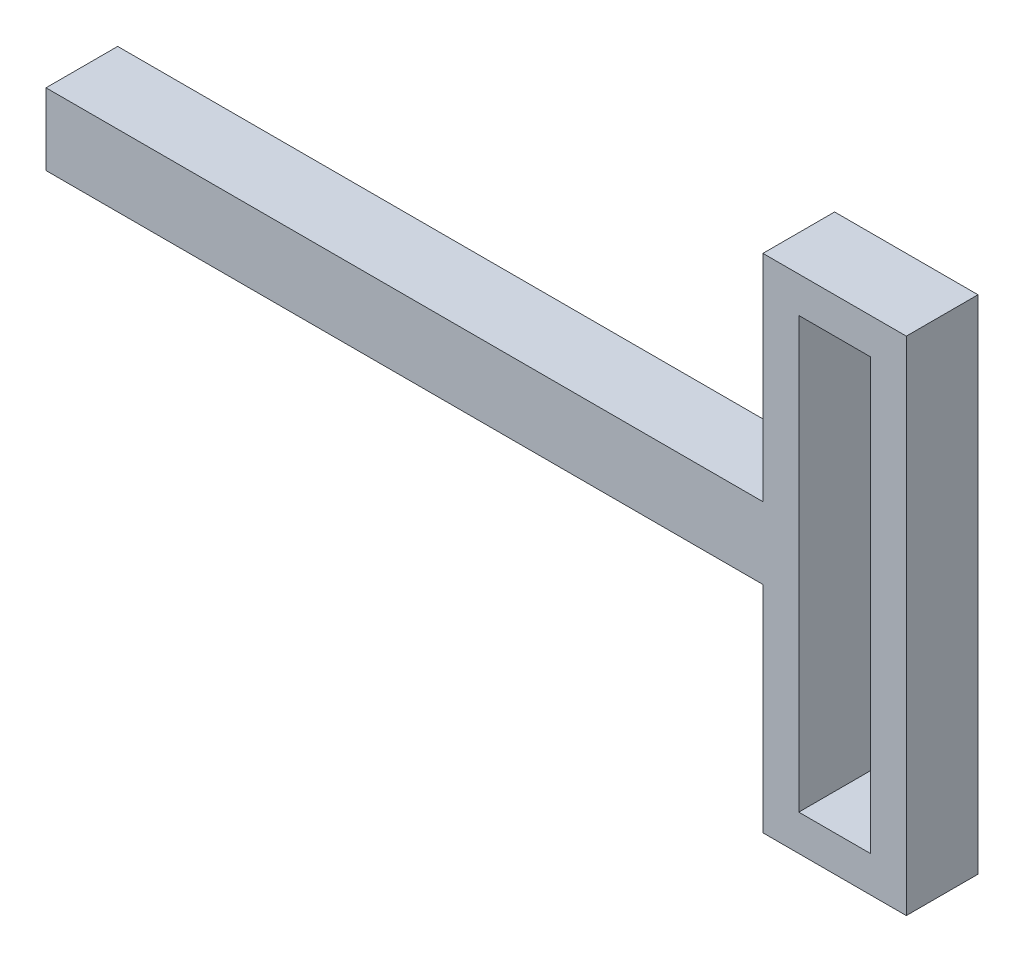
ISO-10303-21;
HEADER;
FILE_DESCRIPTION(('STEP AP214'),'2;1');
FILE_NAME('part.step','',(''),(''),'','','');
FILE_SCHEMA(('AUTOMOTIVE_DESIGN { 1 0 10303 214 1 1 1 1 }'));
ENDSEC;
DATA;
#1=APPLICATION_CONTEXT('core data for automotive mechanical design processes');
#2=APPLICATION_PROTOCOL_DEFINITION('international standard','automotive_design',2000,#1);
#3=PRODUCT_CONTEXT('',#1,'mechanical');
#4=PRODUCT('Part','Part','',(#3));
#5=PRODUCT_RELATED_PRODUCT_CATEGORY('part','',(#4));
#6=PRODUCT_DEFINITION_FORMATION('','',#4);
#7=PRODUCT_DEFINITION_CONTEXT('part definition',#1,'design');
#8=PRODUCT_DEFINITION('design','',#6,#7);
#9=PRODUCT_DEFINITION_SHAPE('','',#8);
#10=(LENGTH_UNIT() NAMED_UNIT(*) SI_UNIT(.MILLI.,.METRE.));
#11=(NAMED_UNIT(*) PLANE_ANGLE_UNIT() SI_UNIT($,.RADIAN.));
#12=(NAMED_UNIT(*) SI_UNIT($,.STERADIAN.) SOLID_ANGLE_UNIT());
#13=UNCERTAINTY_MEASURE_WITH_UNIT(LENGTH_MEASURE(1.E-05),#10,'distance_accuracy_value','');
#14=(GEOMETRIC_REPRESENTATION_CONTEXT(3) GLOBAL_UNCERTAINTY_ASSIGNED_CONTEXT((#13)) GLOBAL_UNIT_ASSIGNED_CONTEXT((#10,
#11,#12)) REPRESENTATION_CONTEXT('',''));
#15=CARTESIAN_POINT('',(0.,0.,0.));
#16=DIRECTION('',(0.,0.,1.));
#17=DIRECTION('',(1.,0.,0.));
#18=AXIS2_PLACEMENT_3D('',#15,#16,#17);
#19=CARTESIAN_POINT('',(100.,0.,10.));
#20=DIRECTION('',(0.,1.,0.));
#21=DIRECTION('',(-1.,0.,0.));
#22=AXIS2_PLACEMENT_3D('',#19,#20,#21);
#23=PLANE('',#22);
#24=DIRECTION('',(1.,0.,0.));
#25=VECTOR('',#24,1.);
#26=CARTESIAN_POINT('',(100.,0.,0.));
#27=LINE('',#26,#25);
#28=CARTESIAN_POINT('',(0.,0.,0.));
#29=VERTEX_POINT('',#28);
#30=CARTESIAN_POINT('',(100.,0.,0.));
#31=VERTEX_POINT('',#30);
#32=EDGE_CURVE('E153',#29,#31,#27,.T.);
#33=ORIENTED_EDGE('',*,*,#32,.T.);
#34=DIRECTION('',(0.,0.,-1.));
#35=VECTOR('',#34,1.);
#36=CARTESIAN_POINT('',(100.,0.,10.));
#37=LINE('',#36,#35);
#38=CARTESIAN_POINT('',(100.,0.,10.));
#39=VERTEX_POINT('',#38);
#40=EDGE_CURVE('E11',#39,#31,#37,.T.);
#41=ORIENTED_EDGE('',*,*,#40,.F.);
#42=DIRECTION('',(1.,0.,0.));
#43=VECTOR('',#42,1.);
#44=CARTESIAN_POINT('',(100.,0.,10.));
#45=LINE('',#44,#43);
#46=CARTESIAN_POINT('',(0.,0.,10.));
#47=VERTEX_POINT('',#46);
#48=EDGE_CURVE('E157',#47,#39,#45,.T.);
#49=ORIENTED_EDGE('',*,*,#48,.F.);
#50=DIRECTION('',(0.,0.,-1.));
#51=VECTOR('',#50,1.);
#52=CARTESIAN_POINT('',(0.,0.,10.));
#53=LINE('',#52,#51);
#54=EDGE_CURVE('E175',#47,#29,#53,.T.);
#55=ORIENTED_EDGE('',*,*,#54,.T.);
#56=EDGE_LOOP('',(#33,#41,#49,#55));
#57=FACE_BOUND('',#56,.T.);
#58=ADVANCED_FACE('F32',(#57),#23,.F.);
#59=CARTESIAN_POINT('',(100.,-30.,10.));
#60=DIRECTION('',(1.,0.,0.));
#61=DIRECTION('',(0.,0.,-1.));
#62=AXIS2_PLACEMENT_3D('',#59,#60,#61);
#63=PLANE('',#62);
#64=DIRECTION('',(0.,-1.,0.));
#65=VECTOR('',#64,1.);
#66=CARTESIAN_POINT('',(100.,-30.,0.));
#67=LINE('',#66,#65);
#68=CARTESIAN_POINT('',(100.,-30.,0.));
#69=VERTEX_POINT('',#68);
#70=EDGE_CURVE('E178',#31,#69,#67,.T.);
#71=ORIENTED_EDGE('',*,*,#70,.T.);
#72=DIRECTION('',(0.,0.,-1.));
#73=VECTOR('',#72,1.);
#74=CARTESIAN_POINT('',(100.,-30.,10.));
#75=LINE('',#74,#73);
#76=CARTESIAN_POINT('',(100.,-30.,10.));
#77=VERTEX_POINT('',#76);
#78=EDGE_CURVE('E39',#77,#69,#75,.T.);
#79=ORIENTED_EDGE('',*,*,#78,.F.);
#80=DIRECTION('',(0.,-1.,0.));
#81=VECTOR('',#80,1.);
#82=CARTESIAN_POINT('',(100.,-30.,10.));
#83=LINE('',#82,#81);
#84=EDGE_CURVE('E160',#39,#77,#83,.T.);
#85=ORIENTED_EDGE('',*,*,#84,.F.);
#86=ORIENTED_EDGE('',*,*,#40,.T.);
#87=EDGE_LOOP('',(#71,#79,#85,#86));
#88=FACE_BOUND('',#87,.T.);
#89=ADVANCED_FACE('F233',(#88),#63,.F.);
#90=CARTESIAN_POINT('',(120.,-30.,10.));
#91=DIRECTION('',(0.,1.,0.));
#92=DIRECTION('',(-1.,0.,0.));
#93=AXIS2_PLACEMENT_3D('',#90,#91,#92);
#94=PLANE('',#93);
#95=DIRECTION('',(1.,0.,0.));
#96=VECTOR('',#95,1.);
#97=CARTESIAN_POINT('',(120.,-30.,0.));
#98=LINE('',#97,#96);
#99=CARTESIAN_POINT('',(120.,-30.,0.));
#100=VERTEX_POINT('',#99);
#101=EDGE_CURVE('E180',#69,#100,#98,.T.);
#102=ORIENTED_EDGE('',*,*,#101,.T.);
#103=DIRECTION('',(0.,0.,-1.));
#104=VECTOR('',#103,1.);
#105=CARTESIAN_POINT('',(120.,-30.,10.));
#106=LINE('',#105,#104);
#107=CARTESIAN_POINT('',(120.,-30.,10.));
#108=VERTEX_POINT('',#107);
#109=EDGE_CURVE('E205',#108,#100,#106,.T.);
#110=ORIENTED_EDGE('',*,*,#109,.F.);
#111=DIRECTION('',(1.,0.,0.));
#112=VECTOR('',#111,1.);
#113=CARTESIAN_POINT('',(120.,-30.,10.));
#114=LINE('',#113,#112);
#115=EDGE_CURVE('E163',#77,#108,#114,.T.);
#116=ORIENTED_EDGE('',*,*,#115,.F.);
#117=ORIENTED_EDGE('',*,*,#78,.T.);
#118=EDGE_LOOP('',(#102,#110,#116,#117));
#119=FACE_BOUND('',#118,.T.);
#120=ADVANCED_FACE('F212',(#119),#94,.F.);
#121=CARTESIAN_POINT('',(120.,40.,10.));
#122=DIRECTION('',(-1.,0.,0.));
#123=DIRECTION('',(0.,-1.,0.));
#124=AXIS2_PLACEMENT_3D('',#121,#122,#123);
#125=PLANE('',#124);
#126=DIRECTION('',(0.,1.,0.));
#127=VECTOR('',#126,1.);
#128=CARTESIAN_POINT('',(120.,40.,0.));
#129=LINE('',#128,#127);
#130=CARTESIAN_POINT('',(120.,40.,0.));
#131=VERTEX_POINT('',#130);
#132=EDGE_CURVE('E182',#100,#131,#129,.T.);
#133=ORIENTED_EDGE('',*,*,#132,.T.);
#134=DIRECTION('',(0.,0.,-1.));
#135=VECTOR('',#134,1.);
#136=CARTESIAN_POINT('',(120.,40.,10.));
#137=LINE('',#136,#135);
#138=CARTESIAN_POINT('',(120.,40.,10.));
#139=VERTEX_POINT('',#138);
#140=EDGE_CURVE('E202',#139,#131,#137,.T.);
#141=ORIENTED_EDGE('',*,*,#140,.F.);
#142=DIRECTION('',(0.,1.,0.));
#143=VECTOR('',#142,1.);
#144=CARTESIAN_POINT('',(120.,40.,10.));
#145=LINE('',#144,#143);
#146=EDGE_CURVE('E165',#108,#139,#145,.T.);
#147=ORIENTED_EDGE('',*,*,#146,.F.);
#148=ORIENTED_EDGE('',*,*,#109,.T.);
#149=EDGE_LOOP('',(#133,#141,#147,#148));
#150=FACE_BOUND('',#149,.T.);
#151=ADVANCED_FACE('F221',(#150),#125,.F.);
#152=CARTESIAN_POINT('',(100.,40.,10.));
#153=DIRECTION('',(0.,-1.,0.));
#154=DIRECTION('',(0.,0.,-1.));
#155=AXIS2_PLACEMENT_3D('',#152,#153,#154);
#156=PLANE('',#155);
#157=DIRECTION('',(-1.,0.,0.));
#158=VECTOR('',#157,1.);
#159=CARTESIAN_POINT('',(100.,40.,0.));
#160=LINE('',#159,#158);
#161=CARTESIAN_POINT('',(100.,40.,0.));
#162=VERTEX_POINT('',#161);
#163=EDGE_CURVE('E184',#131,#162,#160,.T.);
#164=ORIENTED_EDGE('',*,*,#163,.T.);
#165=DIRECTION('',(0.,0.,-1.));
#166=VECTOR('',#165,1.);
#167=CARTESIAN_POINT('',(100.,40.,10.));
#168=LINE('',#167,#166);
#169=CARTESIAN_POINT('',(100.,40.,10.));
#170=VERTEX_POINT('',#169);
#171=EDGE_CURVE('E199',#170,#162,#168,.T.);
#172=ORIENTED_EDGE('',*,*,#171,.F.);
#173=DIRECTION('',(-1.,0.,0.));
#174=VECTOR('',#173,1.);
#175=CARTESIAN_POINT('',(100.,40.,10.));
#176=LINE('',#175,#174);
#177=EDGE_CURVE('E167',#139,#170,#176,.T.);
#178=ORIENTED_EDGE('',*,*,#177,.F.);
#179=ORIENTED_EDGE('',*,*,#140,.T.);
#180=EDGE_LOOP('',(#164,#172,#178,#179));
#181=FACE_BOUND('',#180,.T.);
#182=ADVANCED_FACE('F225',(#181),#156,.F.);
#183=CARTESIAN_POINT('',(100.,10.,10.));
#184=DIRECTION('',(1.,0.,0.));
#185=DIRECTION('',(0.,0.,-1.));
#186=AXIS2_PLACEMENT_3D('',#183,#184,#185);
#187=PLANE('',#186);
#188=DIRECTION('',(0.,-1.,0.));
#189=VECTOR('',#188,1.);
#190=CARTESIAN_POINT('',(100.,10.,0.));
#191=LINE('',#190,#189);
#192=CARTESIAN_POINT('',(100.,10.,0.));
#193=VERTEX_POINT('',#192);
#194=EDGE_CURVE('E186',#162,#193,#191,.T.);
#195=ORIENTED_EDGE('',*,*,#194,.T.);
#196=DIRECTION('',(0.,0.,-1.));
#197=VECTOR('',#196,1.);
#198=CARTESIAN_POINT('',(100.,10.,10.));
#199=LINE('',#198,#197);
#200=CARTESIAN_POINT('',(100.,10.,10.));
#201=VERTEX_POINT('',#200);
#202=EDGE_CURVE('E196',#201,#193,#199,.T.);
#203=ORIENTED_EDGE('',*,*,#202,.F.);
#204=DIRECTION('',(0.,-1.,0.));
#205=VECTOR('',#204,1.);
#206=CARTESIAN_POINT('',(100.,10.,10.));
#207=LINE('',#206,#205);
#208=EDGE_CURVE('E169',#170,#201,#207,.T.);
#209=ORIENTED_EDGE('',*,*,#208,.F.);
#210=ORIENTED_EDGE('',*,*,#171,.T.);
#211=EDGE_LOOP('',(#195,#203,#209,#210));
#212=FACE_BOUND('',#211,.T.);
#213=ADVANCED_FACE('F246',(#212),#187,.F.);
#214=CARTESIAN_POINT('',(0.,10.,10.));
#215=DIRECTION('',(0.,-1.,0.));
#216=DIRECTION('',(0.,0.,-1.));
#217=AXIS2_PLACEMENT_3D('',#214,#215,#216);
#218=PLANE('',#217);
#219=DIRECTION('',(-1.,0.,0.));
#220=VECTOR('',#219,1.);
#221=CARTESIAN_POINT('',(0.,10.,0.));
#222=LINE('',#221,#220);
#223=CARTESIAN_POINT('',(0.,10.,0.));
#224=VERTEX_POINT('',#223);
#225=EDGE_CURVE('E188',#193,#224,#222,.T.);
#226=ORIENTED_EDGE('',*,*,#225,.T.);
#227=DIRECTION('',(0.,0.,-1.));
#228=VECTOR('',#227,1.);
#229=CARTESIAN_POINT('',(0.,10.,10.));
#230=LINE('',#229,#228);
#231=CARTESIAN_POINT('',(0.,10.,10.));
#232=VERTEX_POINT('',#231);
#233=EDGE_CURVE('E193',#232,#224,#230,.T.);
#234=ORIENTED_EDGE('',*,*,#233,.F.);
#235=DIRECTION('',(-1.,0.,0.));
#236=VECTOR('',#235,1.);
#237=CARTESIAN_POINT('',(0.,10.,10.));
#238=LINE('',#237,#236);
#239=EDGE_CURVE('E171',#201,#232,#238,.T.);
#240=ORIENTED_EDGE('',*,*,#239,.F.);
#241=ORIENTED_EDGE('',*,*,#202,.T.);
#242=EDGE_LOOP('',(#226,#234,#240,#241));
#243=FACE_BOUND('',#242,.T.);
#244=ADVANCED_FACE('F244',(#243),#218,.F.);
#245=CARTESIAN_POINT('',(0.,0.,10.));
#246=DIRECTION('',(1.,0.,0.));
#247=DIRECTION('',(0.,0.,-1.));
#248=AXIS2_PLACEMENT_3D('',#245,#246,#247);
#249=PLANE('',#248);
#250=DIRECTION('',(0.,-1.,0.));
#251=VECTOR('',#250,1.);
#252=CARTESIAN_POINT('',(0.,0.,0.));
#253=LINE('',#252,#251);
#254=EDGE_CURVE('E161',#224,#29,#253,.T.);
#255=ORIENTED_EDGE('',*,*,#254,.T.);
#256=ORIENTED_EDGE('',*,*,#54,.F.);
#257=DIRECTION('',(0.,-1.,0.));
#258=VECTOR('',#257,1.);
#259=CARTESIAN_POINT('',(0.,0.,10.));
#260=LINE('',#259,#258);
#261=EDGE_CURVE('E173',#232,#47,#260,.T.);
#262=ORIENTED_EDGE('',*,*,#261,.F.);
#263=ORIENTED_EDGE('',*,*,#233,.T.);
#264=EDGE_LOOP('',(#255,#256,#262,#263));
#265=FACE_BOUND('',#264,.T.);
#266=ADVANCED_FACE('F239',(#265),#249,.F.);
#267=CARTESIAN_POINT('',(0.,0.,10.));
#268=DIRECTION('',(0.,0.,-1.));
#269=DIRECTION('',(-1.,0.,0.));
#270=AXIS2_PLACEMENT_3D('',#267,#268,#269);
#271=PLANE('',#270);
#272=DIRECTION('',(1.,0.,0.));
#273=VECTOR('',#272,1.);
#274=CARTESIAN_POINT('',(105.,-25.,10.));
#275=LINE('',#274,#273);
#276=CARTESIAN_POINT('',(105.,-25.,10.));
#277=VERTEX_POINT('',#276);
#278=CARTESIAN_POINT('',(115.,-25.,10.));
#279=VERTEX_POINT('',#278);
#280=EDGE_CURVE('E147',#277,#279,#275,.T.);
#281=ORIENTED_EDGE('',*,*,#280,.F.);
#282=DIRECTION('',(0.,-1.,0.));
#283=VECTOR('',#282,1.);
#284=CARTESIAN_POINT('',(105.,35.,10.));
#285=LINE('',#284,#283);
#286=CARTESIAN_POINT('',(105.,35.,10.));
#287=VERTEX_POINT('',#286);
#288=EDGE_CURVE('E46',#287,#277,#285,.T.);
#289=ORIENTED_EDGE('',*,*,#288,.F.);
#290=DIRECTION('',(-1.,0.,0.));
#291=VECTOR('',#290,1.);
#292=CARTESIAN_POINT('',(105.,35.,10.));
#293=LINE('',#292,#291);
#294=CARTESIAN_POINT('',(115.,35.,10.));
#295=VERTEX_POINT('',#294);
#296=EDGE_CURVE('E138',#295,#287,#293,.T.);
#297=ORIENTED_EDGE('',*,*,#296,.F.);
#298=DIRECTION('',(0.,1.,0.));
#299=VECTOR('',#298,1.);
#300=CARTESIAN_POINT('',(115.,35.,10.));
#301=LINE('',#300,#299);
#302=EDGE_CURVE('E141',#279,#295,#301,.T.);
#303=ORIENTED_EDGE('',*,*,#302,.F.);
#304=EDGE_LOOP('',(#281,#289,#297,#303));
#305=FACE_BOUND('',#304,.T.);
#306=ORIENTED_EDGE('',*,*,#48,.T.);
#307=ORIENTED_EDGE('',*,*,#84,.T.);
#308=ORIENTED_EDGE('',*,*,#115,.T.);
#309=ORIENTED_EDGE('',*,*,#146,.T.);
#310=ORIENTED_EDGE('',*,*,#177,.T.);
#311=ORIENTED_EDGE('',*,*,#208,.T.);
#312=ORIENTED_EDGE('',*,*,#239,.T.);
#313=ORIENTED_EDGE('',*,*,#261,.T.);
#314=EDGE_LOOP('',(#306,#307,#308,#309,#310,#311,#312,#313));
#315=FACE_BOUND('',#314,.T.);
#316=ADVANCED_FACE('F229',(#305,#315),#271,.F.);
#317=CARTESIAN_POINT('',(0.,0.,0.));
#318=DIRECTION('',(0.,0.,-1.));
#319=DIRECTION('',(-1.,0.,0.));
#320=AXIS2_PLACEMENT_3D('',#317,#318,#319);
#321=PLANE('',#320);
#322=DIRECTION('',(0.,-1.,0.));
#323=VECTOR('',#322,1.);
#324=CARTESIAN_POINT('',(105.,35.,0.));
#325=LINE('',#324,#323);
#326=CARTESIAN_POINT('',(105.,35.,0.));
#327=VERTEX_POINT('',#326);
#328=CARTESIAN_POINT('',(105.,-25.,0.));
#329=VERTEX_POINT('',#328);
#330=EDGE_CURVE('E122',#327,#329,#325,.T.);
#331=ORIENTED_EDGE('',*,*,#330,.T.);
#332=DIRECTION('',(1.,0.,0.));
#333=VECTOR('',#332,1.);
#334=CARTESIAN_POINT('',(105.,-25.,0.));
#335=LINE('',#334,#333);
#336=CARTESIAN_POINT('',(115.,-25.,0.));
#337=VERTEX_POINT('',#336);
#338=EDGE_CURVE('E131',#329,#337,#335,.T.);
#339=ORIENTED_EDGE('',*,*,#338,.T.);
#340=DIRECTION('',(0.,1.,0.));
#341=VECTOR('',#340,1.);
#342=CARTESIAN_POINT('',(115.,35.,0.));
#343=LINE('',#342,#341);
#344=CARTESIAN_POINT('',(115.,35.,0.));
#345=VERTEX_POINT('',#344);
#346=EDGE_CURVE('E54',#337,#345,#343,.T.);
#347=ORIENTED_EDGE('',*,*,#346,.T.);
#348=DIRECTION('',(-1.,0.,0.));
#349=VECTOR('',#348,1.);
#350=CARTESIAN_POINT('',(105.,35.,0.));
#351=LINE('',#350,#349);
#352=EDGE_CURVE('E128',#345,#327,#351,.T.);
#353=ORIENTED_EDGE('',*,*,#352,.T.);
#354=EDGE_LOOP('',(#331,#339,#347,#353));
#355=FACE_BOUND('',#354,.T.);
#356=ORIENTED_EDGE('',*,*,#32,.F.);
#357=ORIENTED_EDGE('',*,*,#254,.F.);
#358=ORIENTED_EDGE('',*,*,#225,.F.);
#359=ORIENTED_EDGE('',*,*,#194,.F.);
#360=ORIENTED_EDGE('',*,*,#163,.F.);
#361=ORIENTED_EDGE('',*,*,#132,.F.);
#362=ORIENTED_EDGE('',*,*,#101,.F.);
#363=ORIENTED_EDGE('',*,*,#70,.F.);
#364=EDGE_LOOP('',(#356,#357,#358,#359,#360,#361,#362,#363));
#365=FACE_BOUND('',#364,.T.);
#366=ADVANCED_FACE('F135',(#355,#365),#321,.T.);
#367=CARTESIAN_POINT('',(105.,35.,0.));
#368=DIRECTION('',(-1.,0.,0.));
#369=DIRECTION('',(0.,-1.,0.));
#370=AXIS2_PLACEMENT_3D('',#367,#368,#369);
#371=PLANE('',#370);
#372=ORIENTED_EDGE('',*,*,#288,.T.);
#373=DIRECTION('',(0.,0.,1.));
#374=VECTOR('',#373,1.);
#375=CARTESIAN_POINT('',(105.,-25.,0.));
#376=LINE('',#375,#374);
#377=EDGE_CURVE('E118',#329,#277,#376,.T.);
#378=ORIENTED_EDGE('',*,*,#377,.F.);
#379=ORIENTED_EDGE('',*,*,#330,.F.);
#380=DIRECTION('',(0.,0.,1.));
#381=VECTOR('',#380,1.);
#382=CARTESIAN_POINT('',(105.,35.,0.));
#383=LINE('',#382,#381);
#384=EDGE_CURVE('E151',#327,#287,#383,.T.);
#385=ORIENTED_EDGE('',*,*,#384,.T.);
#386=EDGE_LOOP('',(#372,#378,#379,#385));
#387=FACE_BOUND('',#386,.T.);
#388=ADVANCED_FACE('F120',(#387),#371,.F.);
#389=CARTESIAN_POINT('',(105.,35.,0.));
#390=DIRECTION('',(0.,1.,0.));
#391=DIRECTION('',(0.,0.,1.));
#392=AXIS2_PLACEMENT_3D('',#389,#390,#391);
#393=PLANE('',#392);
#394=ORIENTED_EDGE('',*,*,#296,.T.);
#395=ORIENTED_EDGE('',*,*,#384,.F.);
#396=ORIENTED_EDGE('',*,*,#352,.F.);
#397=DIRECTION('',(0.,0.,1.));
#398=VECTOR('',#397,1.);
#399=CARTESIAN_POINT('',(115.,35.,0.));
#400=LINE('',#399,#398);
#401=EDGE_CURVE('E154',#345,#295,#400,.T.);
#402=ORIENTED_EDGE('',*,*,#401,.T.);
#403=EDGE_LOOP('',(#394,#395,#396,#402));
#404=FACE_BOUND('',#403,.T.);
#405=ADVANCED_FACE('F317',(#404),#393,.F.);
#406=CARTESIAN_POINT('',(115.,35.,0.));
#407=DIRECTION('',(1.,0.,0.));
#408=DIRECTION('',(0.,1.,0.));
#409=AXIS2_PLACEMENT_3D('',#406,#407,#408);
#410=PLANE('',#409);
#411=ORIENTED_EDGE('',*,*,#302,.T.);
#412=ORIENTED_EDGE('',*,*,#401,.F.);
#413=ORIENTED_EDGE('',*,*,#346,.F.);
#414=DIRECTION('',(0.,0.,1.));
#415=VECTOR('',#414,1.);
#416=CARTESIAN_POINT('',(115.,-25.,0.));
#417=LINE('',#416,#415);
#418=EDGE_CURVE('E127',#337,#279,#417,.T.);
#419=ORIENTED_EDGE('',*,*,#418,.T.);
#420=EDGE_LOOP('',(#411,#412,#413,#419));
#421=FACE_BOUND('',#420,.T.);
#422=ADVANCED_FACE('F326',(#421),#410,.F.);
#423=CARTESIAN_POINT('',(105.,-25.,0.));
#424=DIRECTION('',(0.,-1.,0.));
#425=DIRECTION('',(0.,0.,-1.));
#426=AXIS2_PLACEMENT_3D('',#423,#424,#425);
#427=PLANE('',#426);
#428=ORIENTED_EDGE('',*,*,#280,.T.);
#429=ORIENTED_EDGE('',*,*,#418,.F.);
#430=ORIENTED_EDGE('',*,*,#338,.F.);
#431=ORIENTED_EDGE('',*,*,#377,.T.);
#432=EDGE_LOOP('',(#428,#429,#430,#431));
#433=FACE_BOUND('',#432,.T.);
#434=ADVANCED_FACE('F132',(#433),#427,.F.);
#435=CLOSED_SHELL('',(#58,#89,#120,#151,#182,#213,#244,#266,#316,#366,#388,#405,#422,#434));
#436=MANIFOLD_SOLID_BREP('B2',#435);
#437=ADVANCED_BREP_SHAPE_REPRESENTATION('',(#18,#436),#14);
#438=SHAPE_DEFINITION_REPRESENTATION(#9,#437);
ENDSEC;
END-ISO-10303-21;
